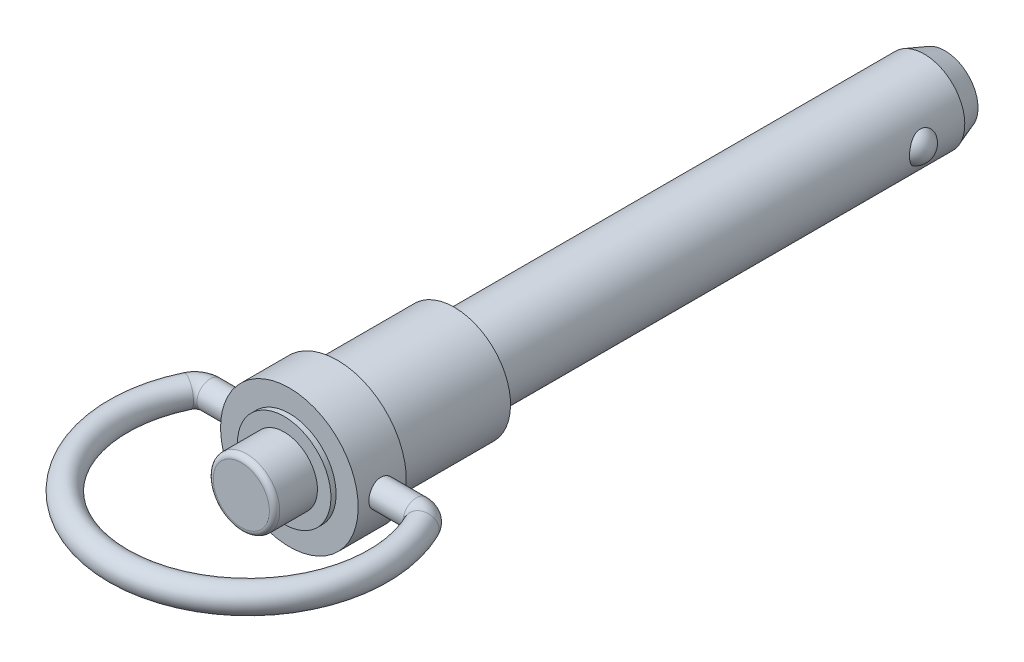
ISO-10303-21;
HEADER;
FILE_DESCRIPTION(('STEP AP214'),'2;1');
FILE_NAME('part.step','',(''),(''),'','','');
FILE_SCHEMA(('AUTOMOTIVE_DESIGN { 1 0 10303 214 1 1 1 1 }'));
ENDSEC;
DATA;
#1=APPLICATION_CONTEXT('core data for automotive mechanical design processes');
#2=APPLICATION_PROTOCOL_DEFINITION('international standard','automotive_design',2000,#1);
#3=PRODUCT_CONTEXT('',#1,'mechanical');
#4=PRODUCT('Part','Part','',(#3));
#5=PRODUCT_RELATED_PRODUCT_CATEGORY('part','',(#4));
#6=PRODUCT_DEFINITION_FORMATION('','',#4);
#7=PRODUCT_DEFINITION_CONTEXT('part definition',#1,'design');
#8=PRODUCT_DEFINITION('design','',#6,#7);
#9=PRODUCT_DEFINITION_SHAPE('','',#8);
#10=(LENGTH_UNIT() NAMED_UNIT(*) SI_UNIT(.MILLI.,.METRE.));
#11=(NAMED_UNIT(*) PLANE_ANGLE_UNIT() SI_UNIT($,.RADIAN.));
#12=(NAMED_UNIT(*) SI_UNIT($,.STERADIAN.) SOLID_ANGLE_UNIT());
#13=UNCERTAINTY_MEASURE_WITH_UNIT(LENGTH_MEASURE(1.E-05),#10,'distance_accuracy_value','');
#14=(GEOMETRIC_REPRESENTATION_CONTEXT(3) GLOBAL_UNCERTAINTY_ASSIGNED_CONTEXT((#13)) GLOBAL_UNIT_ASSIGNED_CONTEXT((#10,
#11,#12)) REPRESENTATION_CONTEXT('',''));
#15=CARTESIAN_POINT('',(0.,0.,0.));
#16=DIRECTION('',(0.,0.,1.));
#17=DIRECTION('',(1.,0.,0.));
#18=AXIS2_PLACEMENT_3D('',#15,#16,#17);
#19=CARTESIAN_POINT('',(0.,0.,20.828));
#20=DIRECTION('',(0.,0.,1.));
#21=DIRECTION('',(0.,-1.,0.));
#22=AXIS2_PLACEMENT_3D('',#19,#20,#21);
#23=PLANE('',#22);
#24=CARTESIAN_POINT('',(0.,0.,20.828));
#25=DIRECTION('',(0.,0.,-1.));
#26=DIRECTION('',(0.,1.,0.));
#27=AXIS2_PLACEMENT_3D('',#24,#25,#26);
#28=CIRCLE('',#27,2.7432);
#29=CARTESIAN_POINT('',(0.,2.7432,20.828));
#30=VERTEX_POINT('',#29);
#31=CARTESIAN_POINT('',(0.,-2.7432,20.828));
#32=VERTEX_POINT('',#31);
#33=EDGE_CURVE('E36',#30,#32,#28,.T.);
#34=ORIENTED_EDGE('',*,*,#33,.F.);
#35=CARTESIAN_POINT('',(0.,0.,20.828));
#36=DIRECTION('',(0.,0.,-1.));
#37=DIRECTION('',(0.,-1.,0.));
#38=AXIS2_PLACEMENT_3D('',#35,#36,#37);
#39=CIRCLE('',#38,2.7432);
#40=EDGE_CURVE('E29',#32,#30,#39,.T.);
#41=ORIENTED_EDGE('',*,*,#40,.F.);
#42=EDGE_LOOP('',(#34,#41));
#43=FACE_BOUND('',#42,.T.);
#44=ADVANCED_FACE('F15',(#43),#23,.T.);
#45=CARTESIAN_POINT('',(0.,0.,20.32));
#46=DIRECTION('',(0.,0.,1.));
#47=DIRECTION('',(0.,-1.,0.));
#48=AXIS2_PLACEMENT_3D('',#45,#46,#47);
#49=TOROIDAL_SURFACE('',#48,2.7432,0.508);
#50=ORIENTED_EDGE('',*,*,#40,.T.);
#51=ORIENTED_EDGE('',*,*,#33,.T.);
#52=EDGE_LOOP('',(#50,#51));
#53=FACE_BOUND('',#52,.T.);
#54=CARTESIAN_POINT('',(0.,0.,20.32));
#55=DIRECTION('',(0.,0.,-1.));
#56=DIRECTION('',(0.,1.,0.));
#57=AXIS2_PLACEMENT_3D('',#54,#55,#56);
#58=CIRCLE('',#57,3.2512);
#59=CARTESIAN_POINT('',(0.,3.2512,20.32));
#60=VERTEX_POINT('',#59);
#61=EDGE_CURVE('E114',#60,#60,#58,.T.);
#62=ORIENTED_EDGE('',*,*,#61,.F.);
#63=EDGE_LOOP('',(#62));
#64=FACE_BOUND('',#63,.T.);
#65=ADVANCED_FACE('F34',(#53,#64),#49,.T.);
#66=CARTESIAN_POINT('',(0.,0.,20.828));
#67=DIRECTION('',(0.,0.,-1.));
#68=DIRECTION('',(0.,1.,0.));
#69=AXIS2_PLACEMENT_3D('',#66,#67,#68);
#70=CYLINDRICAL_SURFACE('',#69,3.2512);
#71=CARTESIAN_POINT('',(0.,0.,16.637));
#72=DIRECTION('',(0.,0.,-1.));
#73=DIRECTION('',(0.,1.,0.));
#74=AXIS2_PLACEMENT_3D('',#71,#72,#73);
#75=CIRCLE('',#74,3.2512);
#76=CARTESIAN_POINT('',(0.,3.2512,16.637));
#77=VERTEX_POINT('',#76);
#78=EDGE_CURVE('E107',#77,#77,#75,.T.);
#79=ORIENTED_EDGE('',*,*,#78,.F.);
#80=EDGE_LOOP('',(#79));
#81=FACE_BOUND('',#80,.T.);
#82=ORIENTED_EDGE('',*,*,#61,.T.);
#83=EDGE_LOOP('',(#82));
#84=FACE_BOUND('',#83,.T.);
#85=ADVANCED_FACE('F90',(#81,#84),#70,.T.);
#86=CARTESIAN_POINT('',(4.572,0.,16.637));
#87=DIRECTION('',(0.,0.,1.));
#88=DIRECTION('',(0.,-1.,0.));
#89=AXIS2_PLACEMENT_3D('',#86,#87,#88);
#90=PLANE('',#89);
#91=ORIENTED_EDGE('',*,*,#78,.T.);
#92=EDGE_LOOP('',(#91));
#93=FACE_BOUND('',#92,.T.);
#94=CARTESIAN_POINT('',(0.,0.,16.637));
#95=DIRECTION('',(0.,0.,-1.));
#96=DIRECTION('',(0.,1.,0.));
#97=AXIS2_PLACEMENT_3D('',#94,#95,#96);
#98=CIRCLE('',#97,4.572);
#99=CARTESIAN_POINT('',(0.,4.572,16.637));
#100=VERTEX_POINT('',#99);
#101=EDGE_CURVE('E106',#100,#100,#98,.T.);
#102=ORIENTED_EDGE('',*,*,#101,.F.);
#103=EDGE_LOOP('',(#102));
#104=FACE_BOUND('',#103,.T.);
#105=ADVANCED_FACE('F93',(#93,#104),#90,.T.);
#106=CARTESIAN_POINT('',(0.,0.,0.));
#107=DIRECTION('',(0.,0.,-1.));
#108=DIRECTION('',(0.,1.,0.));
#109=AXIS2_PLACEMENT_3D('',#106,#107,#108);
#110=CYLINDRICAL_SURFACE('',#109,4.572);
#111=ORIENTED_EDGE('',*,*,#101,.T.);
#112=EDGE_LOOP('',(#111));
#113=FACE_BOUND('',#112,.T.);
#114=CARTESIAN_POINT('',(0.,0.,16.129));
#115=DIRECTION('',(0.,0.,-1.));
#116=DIRECTION('',(0.,1.,0.));
#117=AXIS2_PLACEMENT_3D('',#114,#115,#116);
#118=CIRCLE('',#117,4.572);
#119=CARTESIAN_POINT('',(0.,4.572,16.129));
#120=VERTEX_POINT('',#119);
#121=EDGE_CURVE('E134',#120,#120,#118,.T.);
#122=ORIENTED_EDGE('',*,*,#121,.F.);
#123=EDGE_LOOP('',(#122));
#124=FACE_BOUND('',#123,.T.);
#125=ADVANCED_FACE('F273',(#113,#124),#110,.T.);
#126=CARTESIAN_POINT('',(6.731,0.,16.129));
#127=DIRECTION('',(0.,0.,1.));
#128=DIRECTION('',(0.,-1.,0.));
#129=AXIS2_PLACEMENT_3D('',#126,#127,#128);
#130=PLANE('',#129);
#131=CARTESIAN_POINT('',(0.,0.,16.129));
#132=DIRECTION('',(0.,0.,-1.));
#133=DIRECTION('',(0.,1.,0.));
#134=AXIS2_PLACEMENT_3D('',#131,#132,#133);
#135=CIRCLE('',#134,6.731);
#136=CARTESIAN_POINT('',(0.,6.731,16.129));
#137=VERTEX_POINT('',#136);
#138=EDGE_CURVE('E131',#137,#137,#135,.T.);
#139=ORIENTED_EDGE('',*,*,#138,.F.);
#140=EDGE_LOOP('',(#139));
#141=FACE_BOUND('',#140,.T.);
#142=ORIENTED_EDGE('',*,*,#121,.T.);
#143=EDGE_LOOP('',(#142));
#144=FACE_BOUND('',#143,.T.);
#145=ADVANCED_FACE('F155',(#141,#144),#130,.T.);
#146=CARTESIAN_POINT('',(0.,0.,0.));
#147=DIRECTION('',(0.,0.,-1.));
#148=DIRECTION('',(0.,1.,0.));
#149=AXIS2_PLACEMENT_3D('',#146,#147,#148);
#150=CYLINDRICAL_SURFACE('',#149,6.731);
#151=CARTESIAN_POINT('',(0.,0.,11.43));
#152=DIRECTION('',(0.,0.,-1.));
#153=DIRECTION('',(0.,1.,0.));
#154=AXIS2_PLACEMENT_3D('',#151,#152,#153);
#155=CIRCLE('',#154,6.731);
#156=CARTESIAN_POINT('',(0.,6.731,11.43));
#157=VERTEX_POINT('',#156);
#158=EDGE_CURVE('E122',#157,#157,#155,.T.);
#159=ORIENTED_EDGE('',*,*,#158,.F.);
#160=EDGE_LOOP('',(#159));
#161=FACE_BOUND('',#160,.T.);
#162=ORIENTED_EDGE('',*,*,#138,.T.);
#163=EDGE_LOOP('',(#162));
#164=FACE_BOUND('',#163,.T.);
#165=CARTESIAN_POINT('',(-6.6051722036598,1.2954,13.7922));
#166=CARTESIAN_POINT('',(-6.60517361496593,1.2953972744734,13.864236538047));
#167=CARTESIAN_POINT('',(-6.60636346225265,1.28937073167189,13.9363080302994));
#168=CARTESIAN_POINT('',(-6.61098794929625,1.26544153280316,14.0784162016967));
#169=CARTESIAN_POINT('',(-6.61442445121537,1.24752902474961,14.1484511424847));
#170=CARTESIAN_POINT('',(-6.62313895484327,1.20040052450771,14.2844095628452));
#171=CARTESIAN_POINT('',(-6.62841519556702,1.17119533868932,14.3503369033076));
#172=CARTESIAN_POINT('',(-6.64021258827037,1.10233951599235,14.4763528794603));
#173=CARTESIAN_POINT('',(-6.64673365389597,1.06268960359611,14.5364419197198));
#174=CARTESIAN_POINT('',(-6.66038139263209,0.973516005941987,14.6498669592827));
#175=CARTESIAN_POINT('',(-6.66751428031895,0.9238817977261,14.7031153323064));
#176=CARTESIAN_POINT('',(-6.68152715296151,0.816387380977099,14.8005834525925));
#177=CARTESIAN_POINT('',(-6.6884071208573,0.758526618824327,14.8448025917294));
#178=CARTESIAN_POINT('',(-6.7012057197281,0.635644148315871,14.9232944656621));
#179=CARTESIAN_POINT('',(-6.70711617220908,0.570568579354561,14.9574843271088));
#180=CARTESIAN_POINT('',(-6.71724013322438,0.435464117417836,15.014412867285));
#181=CARTESIAN_POINT('',(-6.72145378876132,0.365435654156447,15.0371525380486));
#182=CARTESIAN_POINT('',(-6.72766549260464,0.223321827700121,15.0702635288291));
#183=CARTESIAN_POINT('',(-6.72968999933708,0.151272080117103,15.0807826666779));
#184=CARTESIAN_POINT('',(-6.73138656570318,0.00640388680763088,15.089614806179));
#185=CARTESIAN_POINT('',(-6.73105883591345,-0.0664144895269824,15.0879289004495));
#186=CARTESIAN_POINT('',(-6.72810846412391,-0.209738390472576,15.072511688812));
#187=CARTESIAN_POINT('',(-6.72551615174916,-0.280261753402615,15.0589395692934));
#188=CARTESIAN_POINT('',(-6.71836197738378,-0.418011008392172,15.0203872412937));
#189=CARTESIAN_POINT('',(-6.71380004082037,-0.485236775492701,14.9954066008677));
#190=CARTESIAN_POINT('',(-6.70316878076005,-0.614941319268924,14.9345963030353));
#191=CARTESIAN_POINT('',(-6.69709072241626,-0.67738974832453,14.8987035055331));
#192=CARTESIAN_POINT('',(-6.68409856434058,-0.795436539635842,14.8171343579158));
#193=CARTESIAN_POINT('',(-6.677184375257,-0.851034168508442,14.7714569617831));
#194=CARTESIAN_POINT('',(-6.66315320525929,-0.954744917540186,14.6707395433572));
#195=CARTESIAN_POINT('',(-6.65603475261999,-1.00272266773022,14.6155602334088));
#196=CARTESIAN_POINT('',(-6.64250376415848,-1.08876420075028,14.4978679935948));
#197=CARTESIAN_POINT('',(-6.63609123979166,-1.12682782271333,14.4353549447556));
#198=CARTESIAN_POINT('',(-6.62469571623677,-1.19200234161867,14.3045844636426));
#199=CARTESIAN_POINT('',(-6.61971540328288,-1.21909269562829,14.2363165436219));
#200=CARTESIAN_POINT('',(-6.61178862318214,-1.26138008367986,14.0960804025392));
#201=CARTESIAN_POINT('',(-6.60884191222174,-1.27657854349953,14.0241126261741));
#202=CARTESIAN_POINT('',(-6.60536444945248,-1.29445125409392,13.8797427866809));
#203=CARTESIAN_POINT('',(-6.60479610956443,-1.29732037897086,13.8073657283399));
#204=CARTESIAN_POINT('',(-6.60603903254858,-1.29097613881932,13.6631669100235));
#205=CARTESIAN_POINT('',(-6.60785017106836,-1.28176340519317,13.5913451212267));
#206=CARTESIAN_POINT('',(-6.6136128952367,-1.25168453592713,13.4509418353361));
#207=CARTESIAN_POINT('',(-6.61754556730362,-1.23092132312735,13.3823374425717));
#208=CARTESIAN_POINT('',(-6.62709183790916,-1.17844042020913,13.249581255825));
#209=CARTESIAN_POINT('',(-6.63270556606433,-1.14672188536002,13.1854298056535));
#210=CARTESIAN_POINT('',(-6.6450665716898,-1.07278507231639,13.0625442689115));
#211=CARTESIAN_POINT('',(-6.65182676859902,-1.03044414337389,13.0038853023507));
#212=CARTESIAN_POINT('',(-6.66568301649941,-0.936629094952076,12.8944341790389));
#213=CARTESIAN_POINT('',(-6.67277909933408,-0.885154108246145,12.8436427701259));
#214=CARTESIAN_POINT('',(-6.68662882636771,-0.773660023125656,12.7506362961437));
#215=CARTESIAN_POINT('',(-6.69337621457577,-0.713530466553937,12.7085525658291));
#216=CARTESIAN_POINT('',(-6.70566168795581,-0.586941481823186,12.6350847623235));
#217=CARTESIAN_POINT('',(-6.71119982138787,-0.520482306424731,12.6037002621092));
#218=CARTESIAN_POINT('',(-6.72041595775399,-0.383476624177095,12.5527164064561));
#219=CARTESIAN_POINT('',(-6.72410395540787,-0.312954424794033,12.5330536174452));
#220=CARTESIAN_POINT('',(-6.72924701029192,-0.169530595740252,12.5058694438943));
#221=CARTESIAN_POINT('',(-6.7307023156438,-0.0966292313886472,12.4983467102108));
#222=CARTESIAN_POINT('',(-6.73121071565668,0.0482259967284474,12.4957052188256));
#223=CARTESIAN_POINT('',(-6.73030215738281,0.120176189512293,12.5003884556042));
#224=CARTESIAN_POINT('',(-6.72626496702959,0.26224403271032,12.5215909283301));
#225=CARTESIAN_POINT('',(-6.72313635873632,0.332361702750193,12.5381100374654));
#226=CARTESIAN_POINT('',(-6.71501101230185,0.468662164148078,12.5824301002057));
#227=CARTESIAN_POINT('',(-6.710017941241,0.534852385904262,12.6102089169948));
#228=CARTESIAN_POINT('',(-6.69870305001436,0.661661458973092,12.6762356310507));
#229=CARTESIAN_POINT('',(-6.69238113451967,0.722279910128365,12.7144842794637));
#230=CARTESIAN_POINT('',(-6.6789853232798,0.837208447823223,12.8010411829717));
#231=CARTESIAN_POINT('',(-6.67190155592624,0.891410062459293,12.8494919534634));
#232=CARTESIAN_POINT('',(-6.65784127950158,0.990982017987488,12.95478313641));
#233=CARTESIAN_POINT('',(-6.65086479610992,1.03635027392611,13.0116255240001));
#234=CARTESIAN_POINT('',(-6.63773378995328,1.11738877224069,13.1327559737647));
#235=CARTESIAN_POINT('',(-6.63158802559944,1.15295925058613,13.1971117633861));
#236=CARTESIAN_POINT('',(-6.62092027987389,1.21272619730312,13.3309847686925));
#237=CARTESIAN_POINT('',(-6.61639678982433,1.23693323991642,13.4004971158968));
#238=CARTESIAN_POINT('',(-6.61041337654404,1.26845390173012,13.5238636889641));
#239=CARTESIAN_POINT('',(-6.60845980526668,1.27854107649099,13.57700269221));
#240=CARTESIAN_POINT('',(-6.60583870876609,1.29201504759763,13.6841545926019));
#241=CARTESIAN_POINT('',(-6.60517114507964,1.29540204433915,13.7381674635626));
#242=CARTESIAN_POINT('',(-6.6051722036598,1.2954,13.7922));
#243=B_SPLINE_CURVE_WITH_KNOTS('',3,(#165,#166,#167,#168,#169,#170,#171,#172,#173,#174,#175,
#176,#177,#178,#179,#180,#181,#182,#183,#184,#185,#186,#187,#188,#189,#190,#191,#192,#193,#194,
#195,#196,#197,#198,#199,#200,#201,#202,#203,#204,#205,#206,#207,#208,#209,#210,#211,#212,#213,
#214,#215,#216,#217,#218,#219,#220,#221,#222,#223,#224,#225,#226,#227,#228,#229,#230,#231,#232,
#233,#234,#235,#236,#237,#238,#239,#240,#241,#242),.UNSPECIFIED.,.T.,.F.,(4,2,2,2,2,2,2,2,2,2,2,
2,2,2,2,2,2,2,2,2,2,2,2,2,2,2,2,2,2,2,2,2,2,2,2,2,2,2,4),(0.,0.215911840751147,
0.432002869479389,0.64788762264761,0.86375740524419,1.08216318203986,1.30058366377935,
1.52076118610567,1.74091962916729,1.95838638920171,2.1758336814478,2.39041258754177,
2.60499961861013,2.82085272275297,3.0367289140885,3.25609136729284,3.47545737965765,
3.69523218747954,3.91498064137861,4.13124273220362,4.34749352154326,4.56184753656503,
4.7762180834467,4.99318797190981,5.21017847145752,5.430235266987,5.65028327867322,
5.86912939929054,6.08795119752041,6.30324544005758,6.51853737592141,6.73340808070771,
6.94829420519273,7.16640910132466,7.38457541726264,7.60488731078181,7.82499378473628,
7.9869478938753,8.14889715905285),.UNSPECIFIED.);
#244=CARTESIAN_POINT('',(-6.6051722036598,1.2954,13.7922));
#245=VERTEX_POINT('',#244);
#246=EDGE_CURVE('E366',#245,#245,#243,.T.);
#247=ORIENTED_EDGE('',*,*,#246,.T.);
#248=EDGE_LOOP('',(#247));
#249=FACE_BOUND('',#248,.T.);
#250=CARTESIAN_POINT('',(6.6051722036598,1.2954,13.7922));
#251=CARTESIAN_POINT('',(6.60517361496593,1.2953972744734,13.720163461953));
#252=CARTESIAN_POINT('',(6.60636346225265,1.2893707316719,13.6480919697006));
#253=CARTESIAN_POINT('',(6.61098794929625,1.26544153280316,13.5059837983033));
#254=CARTESIAN_POINT('',(6.61442445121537,1.24752902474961,13.4359488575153));
#255=CARTESIAN_POINT('',(6.62313895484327,1.20040052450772,13.2999904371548));
#256=CARTESIAN_POINT('',(6.62841519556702,1.17119533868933,13.2340630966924));
#257=CARTESIAN_POINT('',(6.64021258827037,1.10233951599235,13.1080471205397));
#258=CARTESIAN_POINT('',(6.64673365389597,1.06268960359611,13.0479580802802));
#259=CARTESIAN_POINT('',(6.66038139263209,0.973516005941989,12.9345330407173));
#260=CARTESIAN_POINT('',(6.66751428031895,0.923881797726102,12.8812846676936));
#261=CARTESIAN_POINT('',(6.68152715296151,0.816387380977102,12.7838165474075));
#262=CARTESIAN_POINT('',(6.6884071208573,0.758526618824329,12.7395974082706));
#263=CARTESIAN_POINT('',(6.7012057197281,0.635644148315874,12.6611055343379));
#264=CARTESIAN_POINT('',(6.70711617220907,0.570568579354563,12.6269156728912));
#265=CARTESIAN_POINT('',(6.71724013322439,0.435464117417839,12.569987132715));
#266=CARTESIAN_POINT('',(6.72145378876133,0.36543565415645,12.5472474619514));
#267=CARTESIAN_POINT('',(6.72766549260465,0.223321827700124,12.5141364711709));
#268=CARTESIAN_POINT('',(6.72968999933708,0.151272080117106,12.5036173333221));
#269=CARTESIAN_POINT('',(6.73138656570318,0.00640388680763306,12.494785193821));
#270=CARTESIAN_POINT('',(6.73105883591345,-0.0664144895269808,12.4964710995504));
#271=CARTESIAN_POINT('',(6.72810846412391,-0.209738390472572,12.511888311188));
#272=CARTESIAN_POINT('',(6.72551615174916,-0.280261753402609,12.5254604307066));
#273=CARTESIAN_POINT('',(6.71836197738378,-0.418011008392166,12.5640127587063));
#274=CARTESIAN_POINT('',(6.71380004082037,-0.4852367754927,12.5889933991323));
#275=CARTESIAN_POINT('',(6.70316878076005,-0.614941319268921,12.6498036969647));
#276=CARTESIAN_POINT('',(6.69709072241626,-0.67738974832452,12.6856964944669));
#277=CARTESIAN_POINT('',(6.68409856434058,-0.795436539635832,12.7672656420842));
#278=CARTESIAN_POINT('',(6.677184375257,-0.851034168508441,12.8129430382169));
#279=CARTESIAN_POINT('',(6.66315320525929,-0.954744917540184,12.9136604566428));
#280=CARTESIAN_POINT('',(6.65603475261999,-1.00272266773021,12.9688397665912));
#281=CARTESIAN_POINT('',(6.64250376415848,-1.08876420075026,13.0865320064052));
#282=CARTESIAN_POINT('',(6.63609123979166,-1.12682782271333,13.1490450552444));
#283=CARTESIAN_POINT('',(6.62469571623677,-1.19200234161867,13.2798155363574));
#284=CARTESIAN_POINT('',(6.61971540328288,-1.21909269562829,13.3480834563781));
#285=CARTESIAN_POINT('',(6.61178862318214,-1.26138008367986,13.4883195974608));
#286=CARTESIAN_POINT('',(6.60884191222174,-1.27657854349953,13.5602873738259));
#287=CARTESIAN_POINT('',(6.60536444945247,-1.29445125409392,13.7046572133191));
#288=CARTESIAN_POINT('',(6.60479610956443,-1.29732037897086,13.7770342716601));
#289=CARTESIAN_POINT('',(6.60603903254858,-1.29097613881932,13.9212330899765));
#290=CARTESIAN_POINT('',(6.60785017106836,-1.28176340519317,13.9930548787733));
#291=CARTESIAN_POINT('',(6.6136128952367,-1.25168453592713,14.1334581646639));
#292=CARTESIAN_POINT('',(6.61754556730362,-1.23092132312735,14.2020625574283));
#293=CARTESIAN_POINT('',(6.62709183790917,-1.17844042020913,14.334818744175));
#294=CARTESIAN_POINT('',(6.63270556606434,-1.14672188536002,14.3989701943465));
#295=CARTESIAN_POINT('',(6.64506657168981,-1.07278507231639,14.5218557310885));
#296=CARTESIAN_POINT('',(6.65182676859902,-1.03044414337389,14.5805146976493));
#297=CARTESIAN_POINT('',(6.66568301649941,-0.936629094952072,14.6899658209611));
#298=CARTESIAN_POINT('',(6.67277909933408,-0.885154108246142,14.7407572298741));
#299=CARTESIAN_POINT('',(6.68662882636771,-0.773660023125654,14.8337637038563));
#300=CARTESIAN_POINT('',(6.69337621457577,-0.713530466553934,14.8758474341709));
#301=CARTESIAN_POINT('',(6.70566168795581,-0.586941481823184,14.9493152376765));
#302=CARTESIAN_POINT('',(6.71119982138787,-0.520482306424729,14.9806997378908));
#303=CARTESIAN_POINT('',(6.72041595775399,-0.383476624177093,15.0316835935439));
#304=CARTESIAN_POINT('',(6.72410395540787,-0.31295442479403,15.0513463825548));
#305=CARTESIAN_POINT('',(6.72924701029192,-0.169530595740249,15.0785305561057));
#306=CARTESIAN_POINT('',(6.7307023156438,-0.0966292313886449,15.0860532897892));
#307=CARTESIAN_POINT('',(6.73121071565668,0.0482259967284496,15.0886947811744));
#308=CARTESIAN_POINT('',(6.73030215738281,0.120176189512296,15.0840115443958));
#309=CARTESIAN_POINT('',(6.72626496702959,0.262244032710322,15.0628090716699));
#310=CARTESIAN_POINT('',(6.72313635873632,0.332361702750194,15.0462899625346));
#311=CARTESIAN_POINT('',(6.71501101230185,0.46866216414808,15.0019698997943));
#312=CARTESIAN_POINT('',(6.710017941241,0.534852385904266,14.9741910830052));
#313=CARTESIAN_POINT('',(6.69870305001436,0.661661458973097,14.9081643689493));
#314=CARTESIAN_POINT('',(6.69238113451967,0.722279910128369,14.8699157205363));
#315=CARTESIAN_POINT('',(6.6789853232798,0.837208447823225,14.7833588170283));
#316=CARTESIAN_POINT('',(6.67190155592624,0.891410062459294,14.7349080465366));
#317=CARTESIAN_POINT('',(6.65784127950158,0.990982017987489,14.62961686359));
#318=CARTESIAN_POINT('',(6.65086479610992,1.03635027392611,14.5727744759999));
#319=CARTESIAN_POINT('',(6.63773378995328,1.1173887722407,14.4516440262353));
#320=CARTESIAN_POINT('',(6.63158802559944,1.15295925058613,14.3872882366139));
#321=CARTESIAN_POINT('',(6.62092027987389,1.21272619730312,14.2534152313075));
#322=CARTESIAN_POINT('',(6.61639678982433,1.23693323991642,14.1839028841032));
#323=CARTESIAN_POINT('',(6.61041337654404,1.26845390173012,14.0605363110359));
#324=CARTESIAN_POINT('',(6.60845980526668,1.27854107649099,14.00739730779));
#325=CARTESIAN_POINT('',(6.60583870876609,1.29201504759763,13.9002454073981));
#326=CARTESIAN_POINT('',(6.60517114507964,1.29540204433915,13.8462325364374));
#327=CARTESIAN_POINT('',(6.6051722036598,1.2954,13.7922));
#328=B_SPLINE_CURVE_WITH_KNOTS('',3,(#250,#251,#252,#253,#254,#255,#256,#257,#258,#259,#260,
#261,#262,#263,#264,#265,#266,#267,#268,#269,#270,#271,#272,#273,#274,#275,#276,#277,#278,#279,
#280,#281,#282,#283,#284,#285,#286,#287,#288,#289,#290,#291,#292,#293,#294,#295,#296,#297,#298,
#299,#300,#301,#302,#303,#304,#305,#306,#307,#308,#309,#310,#311,#312,#313,#314,#315,#316,#317,
#318,#319,#320,#321,#322,#323,#324,#325,#326,#327),.UNSPECIFIED.,.T.,.F.,(4,2,2,2,2,2,2,2,2,2,2,
2,2,2,2,2,2,2,2,2,2,2,2,2,2,2,2,2,2,2,2,2,2,2,2,2,2,2,4),(0.,0.215911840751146,
0.432002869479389,0.64788762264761,0.86375740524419,1.08216318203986,1.30058366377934,
1.52076118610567,1.74091962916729,1.95838638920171,2.1758336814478,2.39041258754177,
2.60499961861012,2.82085272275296,3.0367289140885,3.25609136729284,3.47545737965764,
3.69523218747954,3.91498064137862,4.13124273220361,4.34749352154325,4.56184753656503,
4.77621808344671,4.99318797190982,5.21017847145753,5.43023526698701,5.65028327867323,
5.86912939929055,6.08795119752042,6.30324544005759,6.51853737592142,6.73340808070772,
6.94829420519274,7.16640910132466,7.38457541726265,7.60488731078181,7.82499378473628,
7.98694789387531,8.14889715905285),.UNSPECIFIED.);
#329=CARTESIAN_POINT('',(6.6051722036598,1.2954,13.7922));
#330=VERTEX_POINT('',#329);
#331=EDGE_CURVE('E210',#330,#330,#328,.T.);
#332=ORIENTED_EDGE('',*,*,#331,.T.);
#333=EDGE_LOOP('',(#332));
#334=FACE_BOUND('',#333,.T.);
#335=ADVANCED_FACE('F149',(#161,#164,#249,#334),#150,.T.);
#336=CARTESIAN_POINT('',(5.7785,0.,11.43));
#337=DIRECTION('',(0.,0.,-1.));
#338=DIRECTION('',(0.,1.,0.));
#339=AXIS2_PLACEMENT_3D('',#336,#337,#338);
#340=PLANE('',#339);
#341=CARTESIAN_POINT('',(0.,0.,11.43));
#342=DIRECTION('',(0.,0.,-1.));
#343=DIRECTION('',(0.,1.,0.));
#344=AXIS2_PLACEMENT_3D('',#341,#342,#343);
#345=CIRCLE('',#344,5.9);
#346=CARTESIAN_POINT('',(0.,5.9,11.43));
#347=VERTEX_POINT('',#346);
#348=EDGE_CURVE('E23',#347,#347,#345,.F.);
#349=ORIENTED_EDGE('',*,*,#348,.T.);
#350=EDGE_LOOP('',(#349));
#351=FACE_BOUND('',#350,.T.);
#352=ORIENTED_EDGE('',*,*,#158,.T.);
#353=EDGE_LOOP('',(#352));
#354=FACE_BOUND('',#353,.T.);
#355=ADVANCED_FACE('F88',(#351,#354),#340,.T.);
#356=CARTESIAN_POINT('',(10.0803124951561,0.,15.3162));
#357=DIRECTION('',(0.,1.,0.));
#358=DIRECTION('',(-1.,0.,0.));
#359=AXIS2_PLACEMENT_3D('',#356,#357,#358);
#360=TOROIDAL_SURFACE('',#359,1.524,1.2954);
#361=CARTESIAN_POINT('',(11.4549005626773,0.,14.658109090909));
#362=DIRECTION('',(-0.431818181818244,0.,-0.901960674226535));
#363=DIRECTION('',(0.901960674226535,0.,-0.431818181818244));
#364=AXIS2_PLACEMENT_3D('',#361,#362,#363);
#365=CIRCLE('',#364,1.2954);
#366=CARTESIAN_POINT('',(12.6233004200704,0.,14.0987318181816));
#367=VERTEX_POINT('',#366);
#368=EDGE_CURVE('E42',#367,#367,#365,.T.);
#369=ORIENTED_EDGE('',*,*,#368,.T.);
#370=EDGE_LOOP('',(#369));
#371=FACE_BOUND('',#370,.T.);
#372=CARTESIAN_POINT('',(10.0803124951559,0.,13.7922));
#373=DIRECTION('',(1.,0.,0.));
#374=DIRECTION('',(0.,1.,0.));
#375=AXIS2_PLACEMENT_3D('',#372,#373,#374);
#376=CIRCLE('',#375,1.2954);
#377=CARTESIAN_POINT('',(10.0803124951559,1.2954,13.7922));
#378=VERTEX_POINT('',#377);
#379=EDGE_CURVE('E108',#378,#378,#376,.F.);
#380=ORIENTED_EDGE('',*,*,#379,.F.);
#381=EDGE_LOOP('',(#380));
#382=FACE_BOUND('',#381,.T.);
#383=ADVANCED_FACE('F60',(#371,#382),#360,.T.);
#384=CARTESIAN_POINT('',(-10.0803124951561,0.,13.7922));
#385=DIRECTION('',(1.,0.,0.));
#386=DIRECTION('',(0.,1.,0.));
#387=AXIS2_PLACEMENT_3D('',#384,#385,#386);
#388=CYLINDRICAL_SURFACE('',#387,1.2954);
#389=ORIENTED_EDGE('',*,*,#331,.F.);
#390=EDGE_LOOP('',(#389));
#391=FACE_BOUND('',#390,.T.);
#392=ORIENTED_EDGE('',*,*,#379,.T.);
#393=EDGE_LOOP('',(#392));
#394=FACE_BOUND('',#393,.T.);
#395=ADVANCED_FACE('F84',(#391,#394),#388,.T.);
#396=CARTESIAN_POINT('',(0.,0.,20.1422));
#397=DIRECTION('',(0.,1.,0.));
#398=DIRECTION('',(-1.,0.,0.));
#399=AXIS2_PLACEMENT_3D('',#396,#397,#398);
#400=TOROIDAL_SURFACE('',#399,12.7,1.2954);
#401=CARTESIAN_POINT('',(-11.4549005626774,0.,14.6581090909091));
#402=DIRECTION('',(-0.43181818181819,0.,0.901960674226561));
#403=DIRECTION('',(-0.901960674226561,0.,-0.43181818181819));
#404=AXIS2_PLACEMENT_3D('',#401,#402,#403);
#405=CIRCLE('',#404,1.2954);
#406=CARTESIAN_POINT('',(-12.6233004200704,0.,14.0987318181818));
#407=VERTEX_POINT('',#406);
#408=EDGE_CURVE('E111',#407,#407,#405,.F.);
#409=ORIENTED_EDGE('',*,*,#408,.F.);
#410=EDGE_LOOP('',(#409));
#411=FACE_BOUND('',#410,.T.);
#412=ORIENTED_EDGE('',*,*,#368,.F.);
#413=EDGE_LOOP('',(#412));
#414=FACE_BOUND('',#413,.T.);
#415=ADVANCED_FACE('F80',(#411,#414),#400,.T.);
#416=CARTESIAN_POINT('',(-10.0803124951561,0.,15.3162));
#417=DIRECTION('',(0.,1.,0.));
#418=DIRECTION('',(-1.,0.,0.));
#419=AXIS2_PLACEMENT_3D('',#416,#417,#418);
#420=TOROIDAL_SURFACE('',#419,1.524,1.2954);
#421=CARTESIAN_POINT('',(-10.0803124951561,0.,13.7922));
#422=DIRECTION('',(1.,0.,0.));
#423=DIRECTION('',(0.,1.,0.));
#424=AXIS2_PLACEMENT_3D('',#421,#422,#423);
#425=CIRCLE('',#424,1.2954);
#426=CARTESIAN_POINT('',(-10.0803124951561,1.2954,13.7922));
#427=VERTEX_POINT('',#426);
#428=EDGE_CURVE('E103',#427,#427,#425,.T.);
#429=ORIENTED_EDGE('',*,*,#428,.F.);
#430=EDGE_LOOP('',(#429));
#431=FACE_BOUND('',#430,.T.);
#432=ORIENTED_EDGE('',*,*,#408,.T.);
#433=EDGE_LOOP('',(#432));
#434=FACE_BOUND('',#433,.T.);
#435=ADVANCED_FACE('F83',(#431,#434),#420,.T.);
#436=CARTESIAN_POINT('',(-10.0803124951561,0.,13.7922));
#437=DIRECTION('',(1.,0.,0.));
#438=DIRECTION('',(0.,1.,0.));
#439=AXIS2_PLACEMENT_3D('',#436,#437,#438);
#440=CYLINDRICAL_SURFACE('',#439,1.2954);
#441=ORIENTED_EDGE('',*,*,#246,.F.);
#442=EDGE_LOOP('',(#441));
#443=FACE_BOUND('',#442,.T.);
#444=ORIENTED_EDGE('',*,*,#428,.T.);
#445=EDGE_LOOP('',(#444));
#446=FACE_BOUND('',#445,.T.);
#447=ADVANCED_FACE('F97',(#443,#446),#440,.T.);
#448=CARTESIAN_POINT('',(0.,0.,37.9163096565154));
#449=DIRECTION('',(0.,0.,-1.));
#450=DIRECTION('',(0.,1.,0.));
#451=AXIS2_PLACEMENT_3D('',#448,#449,#450);
#452=CYLINDRICAL_SURFACE('',#451,5.5);
#453=CARTESIAN_POINT('',(0.,0.,11.03));
#454=DIRECTION('',(0.,0.,-1.));
#455=DIRECTION('',(0.,1.,0.));
#456=AXIS2_PLACEMENT_3D('',#453,#454,#455);
#457=CIRCLE('',#456,5.5);
#458=CARTESIAN_POINT('',(0.,5.5,11.03));
#459=VERTEX_POINT('',#458);
#460=EDGE_CURVE('E9',#459,#459,#457,.T.);
#461=ORIENTED_EDGE('',*,*,#460,.T.);
#462=EDGE_LOOP('',(#461));
#463=FACE_BOUND('',#462,.T.);
#464=CARTESIAN_POINT('',(0.,0.,0.));
#465=DIRECTION('',(0.,0.,-1.));
#466=DIRECTION('',(0.,1.,0.));
#467=AXIS2_PLACEMENT_3D('',#464,#465,#466);
#468=CIRCLE('',#467,5.5);
#469=CARTESIAN_POINT('',(0.,5.5,0.));
#470=VERTEX_POINT('',#469);
#471=EDGE_CURVE('E191',#470,#470,#468,.T.);
#472=ORIENTED_EDGE('',*,*,#471,.F.);
#473=EDGE_LOOP('',(#472));
#474=FACE_BOUND('',#473,.T.);
#475=ADVANCED_FACE('F266',(#463,#474),#452,.T.);
#476=CARTESIAN_POINT('',(3.22979748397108,0.,-47.9908));
#477=DIRECTION('',(0.,0.,1.));
#478=DIRECTION('',(0.,-1.,0.));
#479=AXIS2_PLACEMENT_3D('',#476,#477,#478);
#480=PLANE('',#479);
#481=CARTESIAN_POINT('',(0.,0.,-47.9907999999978));
#482=DIRECTION('',(0.,0.,1.));
#483=DIRECTION('',(0.,-1.,0.));
#484=AXIS2_PLACEMENT_3D('',#481,#482,#483);
#485=CIRCLE('',#484,3.22979748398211);
#486=CARTESIAN_POINT('',(0.,-3.22979748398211,-47.9907999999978));
#487=VERTEX_POINT('',#486);
#488=EDGE_CURVE('E45',#487,#487,#485,.T.);
#489=ORIENTED_EDGE('',*,*,#488,.F.);
#490=EDGE_LOOP('',(#489));
#491=FACE_BOUND('',#490,.T.);
#492=ADVANCED_FACE('F205',(#491),#480,.F.);
#493=CARTESIAN_POINT('',(3.12293,0.,-41.8948));
#494=DIRECTION('',(0.,0.,1.));
#495=DIRECTION('',(1.,0.,0.));
#496=AXIS2_PLACEMENT_3D('',#493,#494,#495);
#497=SPHERICAL_SURFACE('',#496,1.5875);
#498=CARTESIAN_POINT('',(3.969385,0.,-40.5517921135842));
#499=CARTESIAN_POINT('',(3.96938133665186,0.0871787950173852,-40.5517940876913));
#500=CARTESIAN_POINT('',(3.96648576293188,0.174428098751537,-40.5584820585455));
#501=CARTESIAN_POINT('',(3.95516905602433,0.346584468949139,-40.5851998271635));
#502=CARTESIAN_POINT('',(3.94674017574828,0.431488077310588,-40.6052483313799));
#503=CARTESIAN_POINT('',(3.92519423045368,0.596479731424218,-40.6585272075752));
#504=CARTESIAN_POINT('',(3.91207555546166,0.676566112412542,-40.6917621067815));
#505=CARTESIAN_POINT('',(3.88253654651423,0.829452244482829,-40.7710588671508));
#506=CARTESIAN_POINT('',(3.86611699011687,0.902253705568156,-40.8171177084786));
#507=CARTESIAN_POINT('',(3.83222363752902,1.03672093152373,-40.9203356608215));
#508=CARTESIAN_POINT('',(3.81477966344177,1.0985904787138,-40.9772380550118));
#509=CARTESIAN_POINT('',(3.78068495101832,1.21073548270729,-41.1017462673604));
#510=CARTESIAN_POINT('',(3.76403384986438,1.26101628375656,-41.1693471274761));
#511=CARTESIAN_POINT('',(3.73507217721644,1.34426479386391,-41.3077911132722));
#512=CARTESIAN_POINT('',(3.72252093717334,1.37829571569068,-41.3779422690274));
#513=CARTESIAN_POINT('',(3.70178973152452,1.43305274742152,-41.5238520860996));
#514=CARTESIAN_POINT('',(3.69360549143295,1.45379187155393,-41.5996051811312));
#515=CARTESIAN_POINT('',(3.68341966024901,1.47939277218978,-41.7454817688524));
#516=CARTESIAN_POINT('',(3.680835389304,1.4857542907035,-41.8153038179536));
#517=CARTESIAN_POINT('',(3.68040725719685,1.48681628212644,-41.9550414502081));
#518=CARTESIAN_POINT('',(3.68256179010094,1.48152070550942,-42.0249569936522));
#519=CARTESIAN_POINT('',(3.69108766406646,1.46013938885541,-42.1588086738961));
#520=CARTESIAN_POINT('',(3.69721728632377,1.44467149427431,-42.2228608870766));
#521=CARTESIAN_POINT('',(3.71278611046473,1.40417367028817,-42.3474287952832));
#522=CARTESIAN_POINT('',(3.72222570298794,1.37914261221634,-42.4079440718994));
#523=CARTESIAN_POINT('',(3.74389633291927,1.3192072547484,-42.5264268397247));
#524=CARTESIAN_POINT('',(3.75622345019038,1.28394990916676,-42.5841973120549));
#525=CARTESIAN_POINT('',(3.78224213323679,1.2051474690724,-42.6934181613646));
#526=CARTESIAN_POINT('',(3.79593412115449,1.1615998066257,-42.7448665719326));
#527=CARTESIAN_POINT('',(3.82484228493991,1.06277839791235,-42.8454045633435));
#528=CARTESIAN_POINT('',(3.84007638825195,1.00677387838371,-42.893769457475));
#529=CARTESIAN_POINT('',(3.86933265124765,0.887713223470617,-42.9813922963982));
#530=CARTESIAN_POINT('',(3.88335410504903,0.824653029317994,-43.0206449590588));
#531=CARTESIAN_POINT('',(3.90318345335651,0.722863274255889,-43.0740110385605));
#532=CARTESIAN_POINT('',(3.90984058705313,0.686009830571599,-43.0914710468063));
#533=CARTESIAN_POINT('',(3.92226926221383,0.610957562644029,-43.123476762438));
#534=CARTESIAN_POINT('',(3.92804156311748,0.572759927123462,-43.1380249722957));
#535=CARTESIAN_POINT('',(3.94381689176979,0.456514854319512,-43.1772484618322));
#536=CARTESIAN_POINT('',(3.95229851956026,0.376714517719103,-43.197554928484));
#537=CARTESIAN_POINT('',(3.96199329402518,0.247044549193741,-43.2205332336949));
#538=CARTESIAN_POINT('',(3.96475587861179,0.197910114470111,-43.2270073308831));
#539=CARTESIAN_POINT('',(3.96845279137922,0.0991914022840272,-43.2356452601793));
#540=CARTESIAN_POINT('',(3.96938708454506,0.0496071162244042,-43.2378090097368));
#541=CARTESIAN_POINT('',(3.96938133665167,-0.0871787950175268,-43.2378059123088));
#542=CARTESIAN_POINT('',(3.96648576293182,-0.174428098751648,-43.2311179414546));
#543=CARTESIAN_POINT('',(3.95516905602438,-0.34658446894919,-43.2044001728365));
#544=CARTESIAN_POINT('',(3.94674017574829,-0.431488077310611,-43.18435166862));
#545=CARTESIAN_POINT('',(3.92519423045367,-0.596479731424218,-43.1310727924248));
#546=CARTESIAN_POINT('',(3.91207555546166,-0.676566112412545,-43.0978378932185));
#547=CARTESIAN_POINT('',(3.88253654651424,-0.829452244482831,-43.0185411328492));
#548=CARTESIAN_POINT('',(3.86611699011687,-0.902253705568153,-42.9724822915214));
#549=CARTESIAN_POINT('',(3.83222363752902,-1.03672093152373,-42.8692643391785));
#550=CARTESIAN_POINT('',(3.81477966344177,-1.0985904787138,-42.8123619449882));
#551=CARTESIAN_POINT('',(3.78068495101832,-1.2107354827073,-42.6878537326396));
#552=CARTESIAN_POINT('',(3.76403384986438,-1.26101628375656,-42.6202528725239));
#553=CARTESIAN_POINT('',(3.73507217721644,-1.34426479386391,-42.4818088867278));
#554=CARTESIAN_POINT('',(3.72252093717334,-1.37829571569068,-42.4116577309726));
#555=CARTESIAN_POINT('',(3.70178973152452,-1.43305274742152,-42.2657479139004));
#556=CARTESIAN_POINT('',(3.69360549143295,-1.45379187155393,-42.1899948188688));
#557=CARTESIAN_POINT('',(3.68341966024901,-1.47939277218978,-42.0441182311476));
#558=CARTESIAN_POINT('',(3.680835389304,-1.4857542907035,-41.9742961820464));
#559=CARTESIAN_POINT('',(3.68040725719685,-1.48681628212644,-41.8345585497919));
#560=CARTESIAN_POINT('',(3.68256179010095,-1.48152070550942,-41.7646430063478));
#561=CARTESIAN_POINT('',(3.69108766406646,-1.4601393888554,-41.6307913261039));
#562=CARTESIAN_POINT('',(3.69721728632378,-1.44467149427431,-41.5667391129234));
#563=CARTESIAN_POINT('',(3.71278611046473,-1.40417367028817,-41.4421712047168));
#564=CARTESIAN_POINT('',(3.72222570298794,-1.37914261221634,-41.3816559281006));
#565=CARTESIAN_POINT('',(3.74389633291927,-1.3192072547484,-41.2631731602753));
#566=CARTESIAN_POINT('',(3.75622345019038,-1.28394990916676,-41.2054026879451));
#567=CARTESIAN_POINT('',(3.78224213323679,-1.2051474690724,-41.0961818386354));
#568=CARTESIAN_POINT('',(3.79593412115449,-1.1615998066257,-41.0447334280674));
#569=CARTESIAN_POINT('',(3.82484228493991,-1.06277839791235,-40.9441954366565));
#570=CARTESIAN_POINT('',(3.84007638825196,-1.0067738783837,-40.8958305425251));
#571=CARTESIAN_POINT('',(3.86933265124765,-0.887713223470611,-40.8082077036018));
#572=CARTESIAN_POINT('',(3.88335410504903,-0.824653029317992,-40.7689550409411));
#573=CARTESIAN_POINT('',(3.90318345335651,-0.722863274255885,-40.7155889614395));
#574=CARTESIAN_POINT('',(3.90984058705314,-0.686009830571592,-40.6981289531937));
#575=CARTESIAN_POINT('',(3.92226926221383,-0.610957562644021,-40.666123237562));
#576=CARTESIAN_POINT('',(3.92804156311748,-0.572759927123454,-40.6515750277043));
#577=CARTESIAN_POINT('',(3.94381689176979,-0.456514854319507,-40.6123515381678));
#578=CARTESIAN_POINT('',(3.95229851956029,-0.3767145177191,-40.592045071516));
#579=CARTESIAN_POINT('',(3.96199329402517,-0.247044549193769,-40.5690667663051));
#580=CARTESIAN_POINT('',(3.96475587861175,-0.197910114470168,-40.5625926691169));
#581=CARTESIAN_POINT('',(3.96845279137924,-0.0991914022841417,-40.5539547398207));
#582=CARTESIAN_POINT('',(3.96938708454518,-0.0496071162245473,-40.5517909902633));
#583=CARTESIAN_POINT('',(3.969385,0.,-40.5517921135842));
#584=B_SPLINE_CURVE_WITH_KNOTS('',3,(#498,#499,#500,#501,#502,#503,#504,#505,#506,#507,#508,
#509,#510,#511,#512,#513,#514,#515,#516,#517,#518,#519,#520,#521,#522,#523,#524,#525,#526,#527,
#528,#529,#530,#531,#532,#533,#534,#535,#536,#537,#538,#539,#540,#541,#542,#543,#544,#545,#546,
#547,#548,#549,#550,#551,#552,#553,#554,#555,#556,#557,#558,#559,#560,#561,#562,#563,#564,#565,
#566,#567,#568,#569,#570,#571,#572,#573,#574,#575,#576,#577,#578,#579,#580,#581,#582,#583),
.UNSPECIFIED.,.T.,.F.,(4,2,2,2,2,2,2,2,2,2,2,2,2,2,2,2,2,2,2,2,2,2,2,2,2,2,2,2,2,2,2,2,2,2,2,2,
2,2,2,2,2,2,4),(0.,0.261355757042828,0.523078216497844,0.784890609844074,1.04664140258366,
1.30282923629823,1.55889868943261,1.79448362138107,2.02983753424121,2.23921556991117,
2.44852266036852,2.64616391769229,2.84382850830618,3.04935366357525,3.25494258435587,
3.4806694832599,3.70652690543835,3.83036514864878,3.95409650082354,4.20121716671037,
4.34993288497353,4.49865145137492,4.76000720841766,5.0217296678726,5.28354206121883,
5.54529285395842,5.80148068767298,6.05755014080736,6.29313507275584,6.52848898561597,
6.73786702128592,6.94717411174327,7.14481536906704,7.34247995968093,7.54800511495,
7.75359403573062,7.97932093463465,8.2051783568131,8.32901660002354,8.4527479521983,
8.69986861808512,8.8485843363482,8.9973029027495),.UNSPECIFIED.);
#585=CARTESIAN_POINT('',(3.969385,0.,-40.5517921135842));
#586=VERTEX_POINT('',#585);
#587=EDGE_CURVE('E187',#586,#586,#584,.T.);
#588=ORIENTED_EDGE('',*,*,#587,.F.);
#589=EDGE_LOOP('',(#588));
#590=FACE_BOUND('',#589,.T.);
#591=ADVANCED_FACE('F200',(#590),#497,.T.);
#592=CARTESIAN_POINT('',(-3.12207,0.,-41.8948));
#593=DIRECTION('',(0.,0.,1.));
#594=DIRECTION('',(1.,0.,0.));
#595=AXIS2_PLACEMENT_3D('',#592,#593,#594);
#596=SPHERICAL_SURFACE('',#595,1.5875);
#597=CARTESIAN_POINT('',(-3.969385,0.,-43.2372654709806));
#598=CARTESIAN_POINT('',(-3.96938133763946,0.0871655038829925,-43.2372634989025));
#599=CARTESIAN_POINT('',(-3.96648664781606,0.174401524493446,-43.2305767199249));
#600=CARTESIAN_POINT('',(-3.95517337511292,0.346531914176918,-43.2038635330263));
#601=CARTESIAN_POINT('',(-3.94674704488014,0.431422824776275,-43.1838184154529));
#602=CARTESIAN_POINT('',(-3.92520757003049,0.596390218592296,-43.130547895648));
#603=CARTESIAN_POINT('',(-3.91209280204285,0.676465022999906,-43.0973179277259));
#604=CARTESIAN_POINT('',(-3.88256269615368,0.829328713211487,-43.0180318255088));
#605=CARTESIAN_POINT('',(-3.86614813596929,0.902119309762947,-42.9719787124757));
#606=CARTESIAN_POINT('',(-3.83226668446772,1.03656073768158,-42.8687753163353));
#607=CARTESIAN_POINT('',(-3.81482968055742,1.09841593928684,-42.8118824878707));
#608=CARTESIAN_POINT('',(-3.78074977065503,1.2105322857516,-42.6873942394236));
#609=CARTESIAN_POINT('',(-3.76410650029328,1.26079879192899,-42.6198037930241));
#610=CARTESIAN_POINT('',(-3.73516296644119,1.3440117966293,-42.4813917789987));
#611=CARTESIAN_POINT('',(-3.72262152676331,1.37802358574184,-42.4112633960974));
#612=CARTESIAN_POINT('',(-3.70190880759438,1.43274470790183,-42.2654021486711));
#613=CARTESIAN_POINT('',(-3.69373324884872,1.45346707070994,-42.1896748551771));
#614=CARTESIAN_POINT('',(-3.68356253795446,1.47903682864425,-42.0438593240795));
#615=CARTESIAN_POINT('',(-3.6809843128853,1.48538528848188,-41.974072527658));
#616=CARTESIAN_POINT('',(-3.68056466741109,1.48642656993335,-41.8344074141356));
#617=CARTESIAN_POINT('',(-3.68272164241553,1.48112333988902,-41.764529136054));
#618=CARTESIAN_POINT('',(-3.69124841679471,1.45973298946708,-41.6307514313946));
#619=CARTESIAN_POINT('',(-3.69737666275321,1.44426351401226,-41.5667358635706));
#620=CARTESIAN_POINT('',(-3.71293936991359,1.40376833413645,-41.442240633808));
#621=CARTESIAN_POINT('',(-3.7223742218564,1.37874150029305,-41.3817613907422));
#622=CARTESIAN_POINT('',(-3.74403310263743,1.31881886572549,-41.2633463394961));
#623=CARTESIAN_POINT('',(-3.75635326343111,1.28356966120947,-41.2056078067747));
#624=CARTESIAN_POINT('',(-3.78235625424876,1.20478881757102,-41.0964482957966));
#625=CARTESIAN_POINT('',(-3.79603950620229,1.16125461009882,-41.0450292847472));
#626=CARTESIAN_POINT('',(-3.8249299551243,1.0624620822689,-40.9445443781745));
#627=CARTESIAN_POINT('',(-3.84015502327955,1.00647273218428,-40.8962035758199));
#628=CARTESIAN_POINT('',(-3.86939345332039,0.887446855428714,-40.8086250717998));
#629=CARTESIAN_POINT('',(-3.88340610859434,0.82440626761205,-40.7693926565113));
#630=CARTESIAN_POINT('',(-3.90322364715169,0.722645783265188,-40.716052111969));
#631=CARTESIAN_POINT('',(-3.9098772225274,0.685800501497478,-40.6985993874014));
#632=CARTESIAN_POINT('',(-3.92229912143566,0.610765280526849,-40.6666073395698));
#633=CARTESIAN_POINT('',(-3.92806820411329,0.572576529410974,-40.652065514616));
#634=CARTESIAN_POINT('',(-3.94383454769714,0.456359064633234,-40.6128596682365));
#635=CARTESIAN_POINT('',(-3.95231106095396,0.376578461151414,-40.5925629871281));
#636=CARTESIAN_POINT('',(-3.96199909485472,0.246947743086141,-40.5695978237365));
#637=CARTESIAN_POINT('',(-3.96475951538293,0.197832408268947,-40.5631279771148));
#638=CARTESIAN_POINT('',(-3.9684535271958,0.0991523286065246,-40.5544957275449));
#639=CARTESIAN_POINT('',(-3.96938708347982,0.0495875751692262,-40.5523334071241));
#640=CARTESIAN_POINT('',(-3.96938133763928,-0.0871655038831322,-40.5523365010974));
#641=CARTESIAN_POINT('',(-3.96648664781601,-0.174401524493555,-40.559023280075));
#642=CARTESIAN_POINT('',(-3.95517337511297,-0.346531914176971,-40.5857364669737));
#643=CARTESIAN_POINT('',(-3.94674704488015,-0.431422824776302,-40.6057815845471));
#644=CARTESIAN_POINT('',(-3.92520757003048,-0.5963902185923,-40.659052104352));
#645=CARTESIAN_POINT('',(-3.91209280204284,-0.676465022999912,-40.6922820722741));
#646=CARTESIAN_POINT('',(-3.88256269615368,-0.829328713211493,-40.7715681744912));
#647=CARTESIAN_POINT('',(-3.86614813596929,-0.902119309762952,-40.8176212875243));
#648=CARTESIAN_POINT('',(-3.83226668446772,-1.03656073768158,-40.9208246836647));
#649=CARTESIAN_POINT('',(-3.81482968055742,-1.09841593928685,-40.9777175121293));
#650=CARTESIAN_POINT('',(-3.78074977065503,-1.2105322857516,-41.1022057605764));
#651=CARTESIAN_POINT('',(-3.76410650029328,-1.26079879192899,-41.1697962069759));
#652=CARTESIAN_POINT('',(-3.73516296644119,-1.3440117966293,-41.3082082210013));
#653=CARTESIAN_POINT('',(-3.72262152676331,-1.37802358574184,-41.3783366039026));
#654=CARTESIAN_POINT('',(-3.70190880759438,-1.43274470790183,-41.5241978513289));
#655=CARTESIAN_POINT('',(-3.69373324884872,-1.45346707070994,-41.5999251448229));
#656=CARTESIAN_POINT('',(-3.68356253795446,-1.47903682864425,-41.7457406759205));
#657=CARTESIAN_POINT('',(-3.6809843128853,-1.48538528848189,-41.815527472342));
#658=CARTESIAN_POINT('',(-3.68056466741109,-1.48642656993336,-41.9551925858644));
#659=CARTESIAN_POINT('',(-3.68272164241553,-1.48112333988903,-42.025070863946));
#660=CARTESIAN_POINT('',(-3.69124841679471,-1.45973298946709,-42.1588485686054));
#661=CARTESIAN_POINT('',(-3.69737666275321,-1.44426351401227,-42.2228641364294));
#662=CARTESIAN_POINT('',(-3.71293936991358,-1.40376833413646,-42.347359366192));
#663=CARTESIAN_POINT('',(-3.7223742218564,-1.37874150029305,-42.4078386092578));
#664=CARTESIAN_POINT('',(-3.74403310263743,-1.31881886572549,-42.5262536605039));
#665=CARTESIAN_POINT('',(-3.75635326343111,-1.28356966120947,-42.5839921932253));
#666=CARTESIAN_POINT('',(-3.78235625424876,-1.20478881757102,-42.6931517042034));
#667=CARTESIAN_POINT('',(-3.79603950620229,-1.16125461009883,-42.7445707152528));
#668=CARTESIAN_POINT('',(-3.8249299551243,-1.06246208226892,-42.8450556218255));
#669=CARTESIAN_POINT('',(-3.84015502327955,-1.0064727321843,-42.8933964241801));
#670=CARTESIAN_POINT('',(-3.86939345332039,-0.887446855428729,-42.9809749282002));
#671=CARTESIAN_POINT('',(-3.88340610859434,-0.824406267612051,-43.0202073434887));
#672=CARTESIAN_POINT('',(-3.90322364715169,-0.722645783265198,-43.073547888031));
#673=CARTESIAN_POINT('',(-3.9098772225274,-0.685800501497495,-43.0910006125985));
#674=CARTESIAN_POINT('',(-3.92229912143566,-0.610765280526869,-43.1229926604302));
#675=CARTESIAN_POINT('',(-3.92806820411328,-0.57257652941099,-43.137534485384));
#676=CARTESIAN_POINT('',(-3.94383454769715,-0.456359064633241,-43.1767403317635));
#677=CARTESIAN_POINT('',(-3.95231106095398,-0.376578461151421,-43.1970370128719));
#678=CARTESIAN_POINT('',(-3.96199909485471,-0.246947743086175,-43.2200021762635));
#679=CARTESIAN_POINT('',(-3.96475951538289,-0.19783240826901,-43.2264720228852));
#680=CARTESIAN_POINT('',(-3.96845352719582,-0.0991523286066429,-43.235104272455));
#681=CARTESIAN_POINT('',(-3.96938708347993,-0.0495875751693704,-43.2372665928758));
#682=CARTESIAN_POINT('',(-3.969385,0.,-43.2372654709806));
#683=B_SPLINE_CURVE_WITH_KNOTS('',3,(#597,#598,#599,#600,#601,#602,#603,#604,#605,#606,#607,
#608,#609,#610,#611,#612,#613,#614,#615,#616,#617,#618,#619,#620,#621,#622,#623,#624,#625,#626,
#627,#628,#629,#630,#631,#632,#633,#634,#635,#636,#637,#638,#639,#640,#641,#642,#643,#644,#645,
#646,#647,#648,#649,#650,#651,#652,#653,#654,#655,#656,#657,#658,#659,#660,#661,#662,#663,#664,
#665,#666,#667,#668,#669,#670,#671,#672,#673,#674,#675,#676,#677,#678,#679,#680,#681,#682),
.UNSPECIFIED.,.T.,.F.,(4,2,2,2,2,2,2,2,2,2,2,2,2,2,2,2,2,2,2,2,2,2,2,2,2,2,2,2,2,2,2,2,2,2,2,2,
2,2,2,2,2,2,4),(0.,0.261315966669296,0.522998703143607,0.784772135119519,1.04648394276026,
1.30261745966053,1.55863224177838,1.7941272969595,2.02939110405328,2.23866021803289,
2.44785842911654,2.64539457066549,2.84295406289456,3.04838300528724,3.25387573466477,
3.47951765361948,3.70529020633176,3.82909570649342,3.9527943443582,4.19984978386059,
4.34850695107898,4.49716696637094,4.75848293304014,5.02016566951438,5.2819391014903,
5.54365090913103,5.7997844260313,6.05579920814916,6.29129426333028,6.52655807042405,
6.73582718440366,6.94502539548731,7.14256153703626,7.34012102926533,7.54554997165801,
7.75104270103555,7.97668461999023,8.2024571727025,8.32626267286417,8.44996131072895,
8.69701675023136,8.84567391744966,8.99433393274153),.UNSPECIFIED.);
#684=CARTESIAN_POINT('',(-3.969385,0.,-43.2372654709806));
#685=VERTEX_POINT('',#684);
#686=EDGE_CURVE('E38',#685,#685,#683,.T.);
#687=ORIENTED_EDGE('',*,*,#686,.F.);
#688=EDGE_LOOP('',(#687));
#689=FACE_BOUND('',#688,.T.);
#690=ADVANCED_FACE('F172',(#689),#596,.T.);
#691=CARTESIAN_POINT('',(0.,0.,-45.9587999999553));
#692=DIRECTION('',(0.,0.,1.));
#693=DIRECTION('',(0.,-1.,0.));
#694=AXIS2_PLACEMENT_3D('',#691,#692,#693);
#695=CONICAL_SURFACE('',#694,3.9693850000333,0.349065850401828);
#696=ORIENTED_EDGE('',*,*,#488,.T.);
#697=EDGE_LOOP('',(#696));
#698=FACE_BOUND('',#697,.T.);
#699=CARTESIAN_POINT('',(0.,0.,-45.9588));
#700=DIRECTION('',(0.,0.,1.));
#701=DIRECTION('',(0.,-1.,0.));
#702=AXIS2_PLACEMENT_3D('',#699,#700,#701);
#703=CIRCLE('',#702,3.969385);
#704=CARTESIAN_POINT('',(0.,-3.969385,-45.9588));
#705=VERTEX_POINT('',#704);
#706=EDGE_CURVE('E181',#705,#705,#703,.T.);
#707=ORIENTED_EDGE('',*,*,#706,.F.);
#708=EDGE_LOOP('',(#707));
#709=FACE_BOUND('',#708,.T.);
#710=ADVANCED_FACE('F167',(#698,#709),#695,.T.);
#711=CARTESIAN_POINT('',(0.,0.,-20.));
#712=DIRECTION('',(0.,0.,1.));
#713=DIRECTION('',(-0.810321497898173,-0.585985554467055,0.));
#714=AXIS2_PLACEMENT_3D('',#711,#712,#713);
#715=CYLINDRICAL_SURFACE('',#714,3.969385);
#716=CARTESIAN_POINT('',(0.,0.,0.));
#717=DIRECTION('',(0.,0.,-1.));
#718=DIRECTION('',(0.810321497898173,0.585985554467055,0.));
#719=AXIS2_PLACEMENT_3D('',#716,#717,#718);
#720=CIRCLE('',#719,3.969385);
#721=CARTESIAN_POINT('',(3.21647799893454,2.32600227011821,0.));
#722=VERTEX_POINT('',#721);
#723=EDGE_CURVE('E130',#722,#722,#720,.T.);
#724=ORIENTED_EDGE('',*,*,#723,.T.);
#725=EDGE_LOOP('',(#724));
#726=FACE_BOUND('',#725,.T.);
#727=ORIENTED_EDGE('',*,*,#706,.T.);
#728=EDGE_LOOP('',(#727));
#729=FACE_BOUND('',#728,.T.);
#730=ORIENTED_EDGE('',*,*,#686,.T.);
#731=EDGE_LOOP('',(#730));
#732=FACE_BOUND('',#731,.T.);
#733=ORIENTED_EDGE('',*,*,#587,.T.);
#734=EDGE_LOOP('',(#733));
#735=FACE_BOUND('',#734,.T.);
#736=ADVANCED_FACE('F164',(#726,#729,#732,#735),#715,.T.);
#737=CARTESIAN_POINT('',(0.,0.,0.));
#738=DIRECTION('',(0.,0.,-1.));
#739=DIRECTION('',(0.,1.,0.));
#740=AXIS2_PLACEMENT_3D('',#737,#738,#739);
#741=PLANE('',#740);
#742=ORIENTED_EDGE('',*,*,#723,.F.);
#743=EDGE_LOOP('',(#742));
#744=FACE_BOUND('',#743,.T.);
#745=ORIENTED_EDGE('',*,*,#471,.T.);
#746=EDGE_LOOP('',(#745));
#747=FACE_BOUND('',#746,.T.);
#748=ADVANCED_FACE('F162',(#744,#747),#741,.T.);
#749=CARTESIAN_POINT('',(0.,0.,11.03));
#750=DIRECTION('',(0.,0.,-1.));
#751=DIRECTION('',(0.,1.,0.));
#752=AXIS2_PLACEMENT_3D('',#749,#750,#751);
#753=TOROIDAL_SURFACE('',#752,5.9,0.4);
#754=ORIENTED_EDGE('',*,*,#460,.F.);
#755=EDGE_LOOP('',(#754));
#756=FACE_BOUND('',#755,.T.);
#757=ORIENTED_EDGE('',*,*,#348,.F.);
#758=EDGE_LOOP('',(#757));
#759=FACE_BOUND('',#758,.T.);
#760=ADVANCED_FACE('F17',(#756,#759),#753,.F.);
#761=CLOSED_SHELL('',(#44,#65,#85,#105,#125,#145,#335,#355,#383,#395,#415,#435,#447,#475,#492,
#591,#690,#710,#736,#748,#760));
#762=MANIFOLD_SOLID_BREP('B1',#761);
#763=ADVANCED_BREP_SHAPE_REPRESENTATION('',(#18,#762),#14);
#764=SHAPE_DEFINITION_REPRESENTATION(#9,#763);
ENDSEC;
END-ISO-10303-21;
